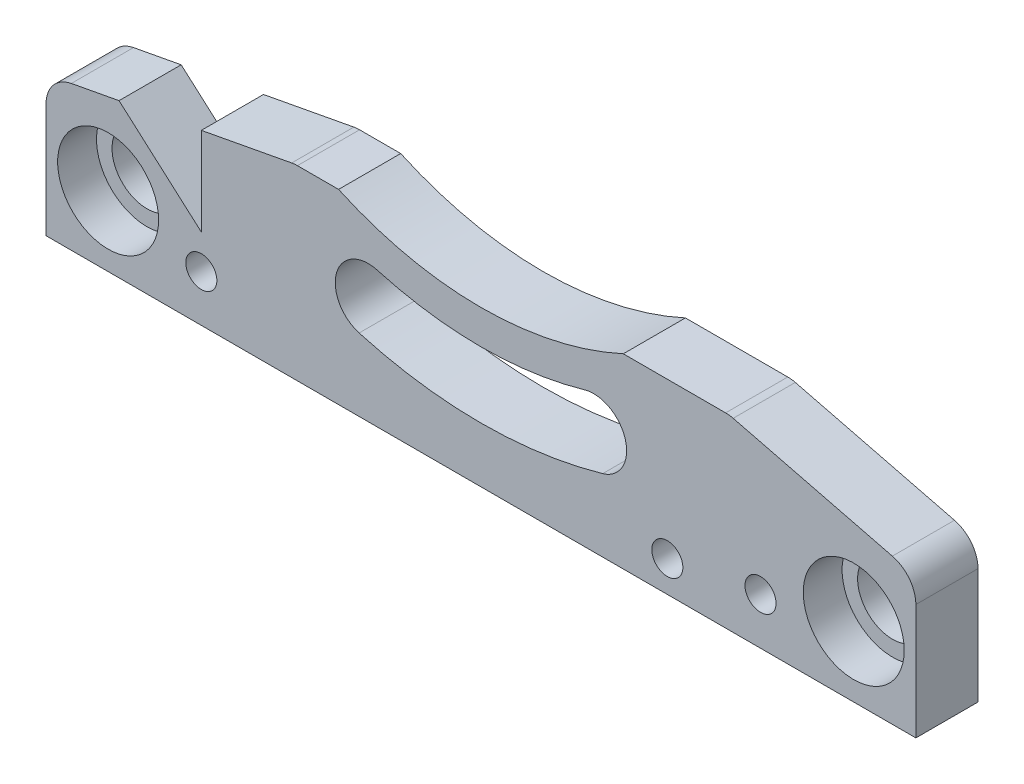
ISO-10303-21;
HEADER;
FILE_DESCRIPTION(('STEP AP214'),'2;1');
FILE_NAME('part.step','',(''),(''),'','','');
FILE_SCHEMA(('AUTOMOTIVE_DESIGN { 1 0 10303 214 1 1 1 1 }'));
ENDSEC;
DATA;
#1=APPLICATION_CONTEXT('core data for automotive mechanical design processes');
#2=APPLICATION_PROTOCOL_DEFINITION('international standard','automotive_design',2000,#1);
#3=PRODUCT_CONTEXT('',#1,'mechanical');
#4=PRODUCT('Part','Part','',(#3));
#5=PRODUCT_RELATED_PRODUCT_CATEGORY('part','',(#4));
#6=PRODUCT_DEFINITION_FORMATION('','',#4);
#7=PRODUCT_DEFINITION_CONTEXT('part definition',#1,'design');
#8=PRODUCT_DEFINITION('design','',#6,#7);
#9=PRODUCT_DEFINITION_SHAPE('','',#8);
#10=(LENGTH_UNIT() NAMED_UNIT(*) SI_UNIT(.MILLI.,.METRE.));
#11=(NAMED_UNIT(*) PLANE_ANGLE_UNIT() SI_UNIT($,.RADIAN.));
#12=(NAMED_UNIT(*) SI_UNIT($,.STERADIAN.) SOLID_ANGLE_UNIT());
#13=UNCERTAINTY_MEASURE_WITH_UNIT(LENGTH_MEASURE(1.E-05),#10,'distance_accuracy_value','');
#14=(GEOMETRIC_REPRESENTATION_CONTEXT(3) GLOBAL_UNCERTAINTY_ASSIGNED_CONTEXT((#13)) GLOBAL_UNIT_ASSIGNED_CONTEXT((#10,
#11,#12)) REPRESENTATION_CONTEXT('',''));
#15=CARTESIAN_POINT('',(0.,0.,0.));
#16=DIRECTION('',(0.,0.,1.));
#17=DIRECTION('',(1.,0.,0.));
#18=AXIS2_PLACEMENT_3D('',#15,#16,#17);
#19=CARTESIAN_POINT('',(-44.45,19.05,0.));
#20=DIRECTION('',(0.,0.,1.));
#21=DIRECTION('',(1.,0.,0.));
#22=AXIS2_PLACEMENT_3D('',#19,#20,#21);
#23=PLANE('',#22);
#24=CARTESIAN_POINT('',(-28.575,4.7625,0.));
#25=DIRECTION('',(0.,0.,1.));
#26=DIRECTION('',(1.,0.,0.));
#27=AXIS2_PLACEMENT_3D('',#24,#25,#26);
#28=CIRCLE('',#27,1.5875);
#29=CARTESIAN_POINT('',(-26.9875,4.7625,0.));
#30=VERTEX_POINT('',#29);
#31=EDGE_CURVE('E576',#30,#30,#28,.T.);
#32=ORIENTED_EDGE('',*,*,#31,.T.);
#33=EDGE_LOOP('',(#32));
#34=FACE_BOUND('',#33,.T.);
#35=CARTESIAN_POINT('',(19.05,3.17500000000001,0.));
#36=DIRECTION('',(0.,0.,1.));
#37=DIRECTION('',(1.,0.,0.));
#38=AXIS2_PLACEMENT_3D('',#35,#36,#37);
#39=CIRCLE('',#38,1.5875);
#40=CARTESIAN_POINT('',(20.6375,3.17500000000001,0.));
#41=VERTEX_POINT('',#40);
#42=EDGE_CURVE('E583',#41,#41,#39,.T.);
#43=ORIENTED_EDGE('',*,*,#42,.T.);
#44=EDGE_LOOP('',(#43));
#45=FACE_BOUND('',#44,.T.);
#46=CARTESIAN_POINT('',(28.575,4.7625,0.));
#47=DIRECTION('',(0.,0.,1.));
#48=DIRECTION('',(1.,0.,0.));
#49=AXIS2_PLACEMENT_3D('',#46,#47,#48);
#50=CIRCLE('',#49,1.5875);
#51=CARTESIAN_POINT('',(30.1625,4.7625,0.));
#52=VERTEX_POINT('',#51);
#53=EDGE_CURVE('E590',#52,#52,#50,.T.);
#54=ORIENTED_EDGE('',*,*,#53,.T.);
#55=EDGE_LOOP('',(#54));
#56=FACE_BOUND('',#55,.T.);
#57=CARTESIAN_POINT('',(-38.1,7.14375,0.));
#58=DIRECTION('',(0.,0.,1.));
#59=DIRECTION('',(1.,0.,0.));
#60=AXIS2_PLACEMENT_3D('',#57,#58,#59);
#61=CIRCLE('',#60,3.57187500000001);
#62=CARTESIAN_POINT('',(-34.528125,7.14375,0.));
#63=VERTEX_POINT('',#62);
#64=EDGE_CURVE('E593',#63,#63,#61,.T.);
#65=ORIENTED_EDGE('',*,*,#64,.T.);
#66=EDGE_LOOP('',(#65));
#67=FACE_BOUND('',#66,.T.);
#68=CARTESIAN_POINT('',(-11.5169556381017,10.6356025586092,0.));
#69=DIRECTION('',(0.,0.,-1.));
#70=DIRECTION('',(-1.,0.,0.));
#71=AXIS2_PLACEMENT_3D('',#68,#69,#70);
#72=CIRCLE('',#71,3.3734375);
#73=CARTESIAN_POINT('',(-12.4468010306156,7.39284630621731,0.));
#74=VERTEX_POINT('',#73);
#75=CARTESIAN_POINT('',(-10.5871102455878,13.8783588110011,0.));
#76=VERTEX_POINT('',#75);
#77=EDGE_CURVE('E166',#74,#76,#72,.T.);
#78=ORIENTED_EDGE('',*,*,#77,.F.);
#79=CARTESIAN_POINT('',(0.,50.8,0.));
#80=DIRECTION('',(0.,0.,-1.));
#81=DIRECTION('',(-1.,0.,0.));
#82=AXIS2_PLACEMENT_3D('',#79,#80,#81);
#83=CIRCLE('',#82,45.1564375);
#84=CARTESIAN_POINT('',(12.4468010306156,7.39284630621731,0.));
#85=VERTEX_POINT('',#84);
#86=EDGE_CURVE('E191',#85,#74,#83,.T.);
#87=ORIENTED_EDGE('',*,*,#86,.F.);
#88=CARTESIAN_POINT('',(11.5169556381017,10.6356025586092,0.));
#89=DIRECTION('',(0.,0.,-1.));
#90=DIRECTION('',(-1.,0.,0.));
#91=AXIS2_PLACEMENT_3D('',#88,#89,#90);
#92=CIRCLE('',#91,3.3734375);
#93=CARTESIAN_POINT('',(10.5871102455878,13.8783588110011,0.));
#94=VERTEX_POINT('',#93);
#95=EDGE_CURVE('E189',#94,#85,#92,.T.);
#96=ORIENTED_EDGE('',*,*,#95,.F.);
#97=CARTESIAN_POINT('',(0.,50.8,0.));
#98=DIRECTION('',(0.,0.,1.));
#99=DIRECTION('',(1.,0.,0.));
#100=AXIS2_PLACEMENT_3D('',#97,#98,#99);
#101=CIRCLE('',#100,38.4095625);
#102=EDGE_CURVE('E176',#76,#94,#101,.T.);
#103=ORIENTED_EDGE('',*,*,#102,.F.);
#104=EDGE_LOOP('',(#78,#87,#96,#103));
#105=FACE_BOUND('',#104,.T.);
#106=DIRECTION('',(-0.970142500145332,0.242535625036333,0.));
#107=VECTOR('',#106,1.);
#108=CARTESIAN_POINT('',(44.45,14.2875,0.));
#109=LINE('',#108,#107);
#110=CARTESIAN_POINT('',(42.0450506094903,14.8887373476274,0.));
#111=VERTEX_POINT('',#110);
#112=CARTESIAN_POINT('',(25.7791902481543,18.9552024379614,0.));
#113=VERTEX_POINT('',#112);
#114=EDGE_CURVE('E243',#111,#113,#109,.T.);
#115=ORIENTED_EDGE('',*,*,#114,.F.);
#116=CARTESIAN_POINT('',(41.275,11.808534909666,0.));
#117=DIRECTION('',(0.,0.,1.));
#118=DIRECTION('',(1.,0.,0.));
#119=AXIS2_PLACEMENT_3D('',#116,#117,#118);
#120=CIRCLE('',#119,3.175);
#121=CARTESIAN_POINT('',(44.45,11.808534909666,0.));
#122=VERTEX_POINT('',#121);
#123=EDGE_CURVE('E299',#111,#122,#120,.F.);
#124=ORIENTED_EDGE('',*,*,#123,.T.);
#125=DIRECTION('',(0.,1.,0.));
#126=VECTOR('',#125,1.);
#127=CARTESIAN_POINT('',(44.45,0.,0.));
#128=LINE('',#127,#126);
#129=CARTESIAN_POINT('',(44.45,0.,0.));
#130=VERTEX_POINT('',#129);
#131=EDGE_CURVE('E264',#130,#122,#128,.T.);
#132=ORIENTED_EDGE('',*,*,#131,.F.);
#133=DIRECTION('',(-1.,0.,0.));
#134=VECTOR('',#133,1.);
#135=CARTESIAN_POINT('',(44.45,0.,0.));
#136=LINE('',#135,#134);
#137=CARTESIAN_POINT('',(-44.45,0.,0.));
#138=VERTEX_POINT('',#137);
#139=EDGE_CURVE('E267',#130,#138,#136,.T.);
#140=ORIENTED_EDGE('',*,*,#139,.T.);
#141=DIRECTION('',(0.,1.,0.));
#142=VECTOR('',#141,1.);
#143=CARTESIAN_POINT('',(-44.45,0.,0.));
#144=LINE('',#143,#142);
#145=CARTESIAN_POINT('',(-44.45,11.6524840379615,0.));
#146=VERTEX_POINT('',#145);
#147=EDGE_CURVE('E270',#138,#146,#144,.T.);
#148=ORIENTED_EDGE('',*,*,#147,.T.);
#149=CARTESIAN_POINT('',(-41.275,11.6524840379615,0.));
#150=DIRECTION('',(0.,0.,1.));
#151=DIRECTION('',(1.,0.,0.));
#152=AXIS2_PLACEMENT_3D('',#149,#150,#151);
#153=CIRCLE('',#152,3.175);
#154=CARTESIAN_POINT('',(-41.8601160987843,14.7731032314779,0.));
#155=VERTEX_POINT('',#154);
#156=EDGE_CURVE('E49',#146,#155,#153,.F.);
#157=ORIENTED_EDGE('',*,*,#156,.T.);
#158=DIRECTION('',(-0.982872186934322,-0.184288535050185,0.));
#159=VECTOR('',#158,1.);
#160=CARTESIAN_POINT('',(-43.587358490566,14.4492452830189,0.));
#161=LINE('',#160,#159);
#162=CARTESIAN_POINT('',(-36.9843867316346,15.6873024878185,0.));
#163=VERTEX_POINT('',#162);
#164=EDGE_CURVE('E230',#163,#155,#161,.T.);
#165=ORIENTED_EDGE('',*,*,#164,.F.);
#166=DIRECTION('',(0.749616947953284,-0.661871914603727,0.));
#167=VECTOR('',#166,1.);
#168=CARTESIAN_POINT('',(-36.9843867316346,15.6873024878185,0.));
#169=LINE('',#168,#167);
#170=CARTESIAN_POINT('',(-28.575,8.26226105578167,0.));
#171=VERTEX_POINT('',#170);
#172=EDGE_CURVE('E212',#163,#171,#169,.T.);
#173=ORIENTED_EDGE('',*,*,#172,.T.);
#174=DIRECTION('',(0.,1.,0.));
#175=VECTOR('',#174,1.);
#176=CARTESIAN_POINT('',(-28.575,8.26226105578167,0.));
#177=LINE('',#176,#175);
#178=CARTESIAN_POINT('',(-28.575,17.2640625,0.));
#179=VERTEX_POINT('',#178);
#180=EDGE_CURVE('E209',#171,#179,#177,.T.);
#181=ORIENTED_EDGE('',*,*,#180,.T.);
#182=CARTESIAN_POINT('',(-19.3400309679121,18.9956191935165,0.));
#183=VERTEX_POINT('',#182);
#184=EDGE_CURVE('E231',#183,#179,#161,.T.);
#185=ORIENTED_EDGE('',*,*,#184,.F.);
#186=CARTESIAN_POINT('',(-18.7549148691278,15.875,0.));
#187=DIRECTION('',(0.,0.,1.));
#188=DIRECTION('',(1.,0.,0.));
#189=AXIS2_PLACEMENT_3D('',#186,#187,#188);
#190=CIRCLE('',#189,3.175);
#191=CARTESIAN_POINT('',(-18.7549148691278,19.05,0.));
#192=VERTEX_POINT('',#191);
#193=EDGE_CURVE('E296',#183,#192,#190,.F.);
#194=ORIENTED_EDGE('',*,*,#193,.T.);
#195=DIRECTION('',(1.,0.,0.));
#196=VECTOR('',#195,1.);
#197=CARTESIAN_POINT('',(-44.45,19.05,0.));
#198=LINE('',#197,#196);
#199=CARTESIAN_POINT('',(-14.5496778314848,19.05,0.));
#200=VERTEX_POINT('',#199);
#201=EDGE_CURVE('E262',#192,#200,#198,.T.);
#202=ORIENTED_EDGE('',*,*,#201,.T.);
#203=CARTESIAN_POINT('',(0.,50.8,0.));
#204=DIRECTION('',(0.,0.,1.));
#205=DIRECTION('',(1.,0.,0.));
#206=AXIS2_PLACEMENT_3D('',#203,#204,#205);
#207=CIRCLE('',#206,34.925);
#208=CARTESIAN_POINT('',(14.5496778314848,19.05,0.));
#209=VERTEX_POINT('',#208);
#210=EDGE_CURVE('E274',#209,#200,#207,.F.);
#211=ORIENTED_EDGE('',*,*,#210,.F.);
#212=CARTESIAN_POINT('',(25.0091396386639,19.05,0.));
#213=VERTEX_POINT('',#212);
#214=EDGE_CURVE('E246',#209,#213,#198,.T.);
#215=ORIENTED_EDGE('',*,*,#214,.T.);
#216=CARTESIAN_POINT('',(25.0091396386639,15.875,0.));
#217=DIRECTION('',(0.,0.,1.));
#218=DIRECTION('',(1.,0.,0.));
#219=AXIS2_PLACEMENT_3D('',#216,#217,#218);
#220=CIRCLE('',#219,3.175);
#221=EDGE_CURVE('E294',#213,#113,#220,.F.);
#222=ORIENTED_EDGE('',*,*,#221,.T.);
#223=EDGE_LOOP('',(#115,#124,#132,#140,#148,#157,#165,#173,#181,#185,#194,#202,#211,#215,#222));
#224=FACE_BOUND('',#223,.T.);
#225=CARTESIAN_POINT('',(38.1,7.14375,0.));
#226=DIRECTION('',(0.,0.,1.));
#227=DIRECTION('',(1.,0.,0.));
#228=AXIS2_PLACEMENT_3D('',#225,#226,#227);
#229=CIRCLE('',#228,3.57187500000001);
#230=CARTESIAN_POINT('',(41.671875,7.14375,0.));
#231=VERTEX_POINT('',#230);
#232=EDGE_CURVE('E607',#231,#231,#229,.T.);
#233=ORIENTED_EDGE('',*,*,#232,.T.);
#234=EDGE_LOOP('',(#233));
#235=FACE_BOUND('',#234,.T.);
#236=ADVANCED_FACE('F34',(#34,#45,#56,#67,#105,#224,#235),#23,.F.);
#237=CARTESIAN_POINT('',(-44.45,19.05,6.35));
#238=DIRECTION('',(0.,0.,1.));
#239=DIRECTION('',(1.,0.,0.));
#240=AXIS2_PLACEMENT_3D('',#237,#238,#239);
#241=PLANE('',#240);
#242=CARTESIAN_POINT('',(-28.575,4.7625,6.35));
#243=DIRECTION('',(0.,0.,1.));
#244=DIRECTION('',(1.,0.,0.));
#245=AXIS2_PLACEMENT_3D('',#242,#243,#244);
#246=CIRCLE('',#245,1.5875);
#247=CARTESIAN_POINT('',(-26.9875,4.7625,6.35));
#248=VERTEX_POINT('',#247);
#249=EDGE_CURVE('E579',#248,#248,#246,.T.);
#250=ORIENTED_EDGE('',*,*,#249,.F.);
#251=EDGE_LOOP('',(#250));
#252=FACE_BOUND('',#251,.T.);
#253=CARTESIAN_POINT('',(19.05,3.17500000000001,6.34999999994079));
#254=DIRECTION('',(0.,0.,1.));
#255=DIRECTION('',(1.,0.,0.));
#256=AXIS2_PLACEMENT_3D('',#253,#254,#255);
#257=CIRCLE('',#256,1.5875);
#258=CARTESIAN_POINT('',(20.6375,3.17500000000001,6.34999999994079));
#259=VERTEX_POINT('',#258);
#260=EDGE_CURVE('E580',#259,#259,#257,.T.);
#261=ORIENTED_EDGE('',*,*,#260,.F.);
#262=EDGE_LOOP('',(#261));
#263=FACE_BOUND('',#262,.T.);
#264=CARTESIAN_POINT('',(28.575,4.7625,6.35));
#265=DIRECTION('',(0.,0.,1.));
#266=DIRECTION('',(1.,0.,0.));
#267=AXIS2_PLACEMENT_3D('',#264,#265,#266);
#268=CIRCLE('',#267,1.5875);
#269=CARTESIAN_POINT('',(30.1625,4.7625,6.35));
#270=VERTEX_POINT('',#269);
#271=EDGE_CURVE('E588',#270,#270,#268,.T.);
#272=ORIENTED_EDGE('',*,*,#271,.F.);
#273=EDGE_LOOP('',(#272));
#274=FACE_BOUND('',#273,.T.);
#275=CARTESIAN_POINT('',(-38.1,7.14375,6.35));
#276=DIRECTION('',(0.,0.,1.));
#277=DIRECTION('',(1.,0.,0.));
#278=AXIS2_PLACEMENT_3D('',#275,#276,#277);
#279=CIRCLE('',#278,5.15937499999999);
#280=CARTESIAN_POINT('',(-32.940625,7.14375,6.35));
#281=VERTEX_POINT('',#280);
#282=EDGE_CURVE('E604',#281,#281,#279,.T.);
#283=ORIENTED_EDGE('',*,*,#282,.F.);
#284=EDGE_LOOP('',(#283));
#285=FACE_BOUND('',#284,.T.);
#286=CARTESIAN_POINT('',(0.,50.8,6.35));
#287=DIRECTION('',(0.,0.,-1.));
#288=DIRECTION('',(-1.,0.,0.));
#289=AXIS2_PLACEMENT_3D('',#286,#287,#288);
#290=CIRCLE('',#289,45.1564375);
#291=CARTESIAN_POINT('',(12.4468010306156,7.39284630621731,6.35));
#292=VERTEX_POINT('',#291);
#293=CARTESIAN_POINT('',(-12.4468010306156,7.39284630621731,6.35));
#294=VERTEX_POINT('',#293);
#295=EDGE_CURVE('E177',#292,#294,#290,.T.);
#296=ORIENTED_EDGE('',*,*,#295,.T.);
#297=CARTESIAN_POINT('',(-11.5169556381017,10.6356025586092,6.35));
#298=DIRECTION('',(0.,0.,-1.));
#299=DIRECTION('',(-1.,0.,0.));
#300=AXIS2_PLACEMENT_3D('',#297,#298,#299);
#301=CIRCLE('',#300,3.3734375);
#302=CARTESIAN_POINT('',(-10.5871102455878,13.8783588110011,6.35));
#303=VERTEX_POINT('',#302);
#304=EDGE_CURVE('E196',#294,#303,#301,.T.);
#305=ORIENTED_EDGE('',*,*,#304,.T.);
#306=CARTESIAN_POINT('',(0.,50.8,6.35));
#307=DIRECTION('',(0.,0.,1.));
#308=DIRECTION('',(1.,0.,0.));
#309=AXIS2_PLACEMENT_3D('',#306,#307,#308);
#310=CIRCLE('',#309,38.4095625);
#311=CARTESIAN_POINT('',(10.5871102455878,13.8783588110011,6.35));
#312=VERTEX_POINT('',#311);
#313=EDGE_CURVE('E183',#303,#312,#310,.T.);
#314=ORIENTED_EDGE('',*,*,#313,.T.);
#315=CARTESIAN_POINT('',(11.5169556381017,10.6356025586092,6.35));
#316=DIRECTION('',(0.,0.,-1.));
#317=DIRECTION('',(-1.,0.,0.));
#318=AXIS2_PLACEMENT_3D('',#315,#316,#317);
#319=CIRCLE('',#318,3.3734375);
#320=EDGE_CURVE('E200',#312,#292,#319,.T.);
#321=ORIENTED_EDGE('',*,*,#320,.T.);
#322=EDGE_LOOP('',(#296,#305,#314,#321));
#323=FACE_BOUND('',#322,.T.);
#324=DIRECTION('',(0.,1.,0.));
#325=VECTOR('',#324,1.);
#326=CARTESIAN_POINT('',(44.45,0.,6.35));
#327=LINE('',#326,#325);
#328=CARTESIAN_POINT('',(44.45,0.,6.35));
#329=VERTEX_POINT('',#328);
#330=CARTESIAN_POINT('',(44.45,11.808534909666,6.35));
#331=VERTEX_POINT('',#330);
#332=EDGE_CURVE('E251',#329,#331,#327,.T.);
#333=ORIENTED_EDGE('',*,*,#332,.T.);
#334=CARTESIAN_POINT('',(41.275,11.808534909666,6.35));
#335=DIRECTION('',(0.,0.,1.));
#336=DIRECTION('',(1.,0.,0.));
#337=AXIS2_PLACEMENT_3D('',#334,#335,#336);
#338=CIRCLE('',#337,3.175);
#339=CARTESIAN_POINT('',(42.0450506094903,14.8887373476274,6.35));
#340=VERTEX_POINT('',#339);
#341=EDGE_CURVE('E287',#331,#340,#338,.T.);
#342=ORIENTED_EDGE('',*,*,#341,.T.);
#343=DIRECTION('',(-0.970142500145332,0.242535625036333,0.));
#344=VECTOR('',#343,1.);
#345=CARTESIAN_POINT('',(44.45,14.2875,6.35));
#346=LINE('',#345,#344);
#347=CARTESIAN_POINT('',(25.7791902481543,18.9552024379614,6.35));
#348=VERTEX_POINT('',#347);
#349=EDGE_CURVE('E240',#340,#348,#346,.T.);
#350=ORIENTED_EDGE('',*,*,#349,.T.);
#351=CARTESIAN_POINT('',(25.0091396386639,15.875,6.35));
#352=DIRECTION('',(0.,0.,1.));
#353=DIRECTION('',(1.,0.,0.));
#354=AXIS2_PLACEMENT_3D('',#351,#352,#353);
#355=CIRCLE('',#354,3.175);
#356=CARTESIAN_POINT('',(25.0091396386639,19.05,6.35));
#357=VERTEX_POINT('',#356);
#358=EDGE_CURVE('E281',#348,#357,#355,.T.);
#359=ORIENTED_EDGE('',*,*,#358,.T.);
#360=DIRECTION('',(1.,0.,0.));
#361=VECTOR('',#360,1.);
#362=CARTESIAN_POINT('',(-44.45,19.05,6.35));
#363=LINE('',#362,#361);
#364=CARTESIAN_POINT('',(14.5496778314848,19.05,6.35));
#365=VERTEX_POINT('',#364);
#366=EDGE_CURVE('E252',#365,#357,#363,.T.);
#367=ORIENTED_EDGE('',*,*,#366,.F.);
#368=CARTESIAN_POINT('',(0.,50.8,6.35));
#369=DIRECTION('',(0.,0.,1.));
#370=DIRECTION('',(1.,0.,0.));
#371=AXIS2_PLACEMENT_3D('',#368,#369,#370);
#372=CIRCLE('',#371,34.925);
#373=CARTESIAN_POINT('',(-14.5496778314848,19.05,6.35));
#374=VERTEX_POINT('',#373);
#375=EDGE_CURVE('E234',#374,#365,#372,.T.);
#376=ORIENTED_EDGE('',*,*,#375,.F.);
#377=CARTESIAN_POINT('',(-18.7549148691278,19.05,6.35));
#378=VERTEX_POINT('',#377);
#379=EDGE_CURVE('E249',#378,#374,#363,.T.);
#380=ORIENTED_EDGE('',*,*,#379,.F.);
#381=CARTESIAN_POINT('',(-18.7549148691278,15.875,6.35));
#382=DIRECTION('',(0.,0.,1.));
#383=DIRECTION('',(1.,0.,0.));
#384=AXIS2_PLACEMENT_3D('',#381,#382,#383);
#385=CIRCLE('',#384,3.175);
#386=CARTESIAN_POINT('',(-19.3400309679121,18.9956191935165,6.35));
#387=VERTEX_POINT('',#386);
#388=EDGE_CURVE('E283',#378,#387,#385,.T.);
#389=ORIENTED_EDGE('',*,*,#388,.T.);
#390=DIRECTION('',(0.982872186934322,0.184288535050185,0.));
#391=VECTOR('',#390,1.);
#392=CARTESIAN_POINT('',(-44.45,14.2875,6.35));
#393=LINE('',#392,#391);
#394=CARTESIAN_POINT('',(-28.575,17.2640625,6.35));
#395=VERTEX_POINT('',#394);
#396=EDGE_CURVE('E227',#395,#387,#393,.T.);
#397=ORIENTED_EDGE('',*,*,#396,.F.);
#398=DIRECTION('',(0.,1.,0.));
#399=VECTOR('',#398,1.);
#400=CARTESIAN_POINT('',(-28.575,8.26226105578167,6.35));
#401=LINE('',#400,#399);
#402=CARTESIAN_POINT('',(-28.575,8.26226105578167,6.35));
#403=VERTEX_POINT('',#402);
#404=EDGE_CURVE('E184',#403,#395,#401,.T.);
#405=ORIENTED_EDGE('',*,*,#404,.F.);
#406=DIRECTION('',(0.749616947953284,-0.661871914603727,0.));
#407=VECTOR('',#406,1.);
#408=CARTESIAN_POINT('',(-36.9843867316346,15.6873024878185,6.35));
#409=LINE('',#408,#407);
#410=CARTESIAN_POINT('',(-36.9843867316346,15.6873024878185,6.35));
#411=VERTEX_POINT('',#410);
#412=EDGE_CURVE('E213',#411,#403,#409,.T.);
#413=ORIENTED_EDGE('',*,*,#412,.F.);
#414=CARTESIAN_POINT('',(-41.8601160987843,14.7731032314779,6.35));
#415=VERTEX_POINT('',#414);
#416=EDGE_CURVE('E228',#415,#411,#393,.T.);
#417=ORIENTED_EDGE('',*,*,#416,.F.);
#418=CARTESIAN_POINT('',(-41.275,11.6524840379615,6.35));
#419=DIRECTION('',(0.,0.,1.));
#420=DIRECTION('',(1.,0.,0.));
#421=AXIS2_PLACEMENT_3D('',#418,#419,#420);
#422=CIRCLE('',#421,3.175);
#423=CARTESIAN_POINT('',(-44.45,11.6524840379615,6.35));
#424=VERTEX_POINT('',#423);
#425=EDGE_CURVE('E285',#415,#424,#422,.T.);
#426=ORIENTED_EDGE('',*,*,#425,.T.);
#427=DIRECTION('',(0.,1.,0.));
#428=VECTOR('',#427,1.);
#429=CARTESIAN_POINT('',(-44.45,0.,6.35));
#430=LINE('',#429,#428);
#431=CARTESIAN_POINT('',(-44.45,0.,6.35));
#432=VERTEX_POINT('',#431);
#433=EDGE_CURVE('E258',#432,#424,#430,.T.);
#434=ORIENTED_EDGE('',*,*,#433,.F.);
#435=DIRECTION('',(-1.,0.,0.));
#436=VECTOR('',#435,1.);
#437=CARTESIAN_POINT('',(44.45,0.,6.35));
#438=LINE('',#437,#436);
#439=EDGE_CURVE('E255',#329,#432,#438,.T.);
#440=ORIENTED_EDGE('',*,*,#439,.F.);
#441=EDGE_LOOP('',(#333,#342,#350,#359,#367,#376,#380,#389,#397,#405,#413,#417,#426,#434,#440));
#442=FACE_BOUND('',#441,.T.);
#443=CARTESIAN_POINT('',(38.1,7.14375,6.35));
#444=DIRECTION('',(0.,0.,1.));
#445=DIRECTION('',(1.,0.,0.));
#446=AXIS2_PLACEMENT_3D('',#443,#444,#445);
#447=CIRCLE('',#446,5.15937499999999);
#448=CARTESIAN_POINT('',(43.259375,7.14375,6.35));
#449=VERTEX_POINT('',#448);
#450=EDGE_CURVE('E198',#449,#449,#447,.T.);
#451=ORIENTED_EDGE('',*,*,#450,.F.);
#452=EDGE_LOOP('',(#451));
#453=FACE_BOUND('',#452,.T.);
#454=ADVANCED_FACE('F316',(#252,#263,#274,#285,#323,#442,#453),#241,.T.);
#455=CARTESIAN_POINT('',(-44.45,14.2875,6.35));
#456=DIRECTION('',(-0.184288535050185,0.982872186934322,0.));
#457=DIRECTION('',(-0.982872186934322,-0.184288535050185,0.));
#458=AXIS2_PLACEMENT_3D('',#455,#456,#457);
#459=PLANE('',#458);
#460=ORIENTED_EDGE('',*,*,#396,.T.);
#461=DIRECTION('',(0.,0.,-1.));
#462=VECTOR('',#461,1.);
#463=CARTESIAN_POINT('',(-19.3400309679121,18.9956191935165,6.35));
#464=LINE('',#463,#462);
#465=EDGE_CURVE('E305',#387,#183,#464,.T.);
#466=ORIENTED_EDGE('',*,*,#465,.T.);
#467=ORIENTED_EDGE('',*,*,#184,.T.);
#468=DIRECTION('',(0.,0.,1.));
#469=VECTOR('',#468,1.);
#470=CARTESIAN_POINT('',(-28.575,17.2640625,0.));
#471=LINE('',#470,#469);
#472=EDGE_CURVE('E224',#179,#395,#471,.T.);
#473=ORIENTED_EDGE('',*,*,#472,.T.);
#474=EDGE_LOOP('',(#460,#466,#467,#473));
#475=FACE_BOUND('',#474,.T.);
#476=ADVANCED_FACE('F326',(#475),#459,.T.);
#477=CARTESIAN_POINT('',(-44.45,19.05,6.35));
#478=DIRECTION('',(0.,1.,0.));
#479=DIRECTION('',(-1.,0.,0.));
#480=AXIS2_PLACEMENT_3D('',#477,#478,#479);
#481=PLANE('',#480);
#482=ORIENTED_EDGE('',*,*,#201,.F.);
#483=DIRECTION('',(0.,0.,-1.));
#484=VECTOR('',#483,1.);
#485=CARTESIAN_POINT('',(-18.7549148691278,19.05,6.35));
#486=LINE('',#485,#484);
#487=EDGE_CURVE('E42',#192,#378,#486,.F.);
#488=ORIENTED_EDGE('',*,*,#487,.T.);
#489=ORIENTED_EDGE('',*,*,#379,.T.);
#490=DIRECTION('',(0.,0.,-1.));
#491=VECTOR('',#490,1.);
#492=CARTESIAN_POINT('',(-14.5496778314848,19.05,6.35));
#493=LINE('',#492,#491);
#494=EDGE_CURVE('E233',#374,#200,#493,.T.);
#495=ORIENTED_EDGE('',*,*,#494,.T.);
#496=EDGE_LOOP('',(#482,#488,#489,#495));
#497=FACE_BOUND('',#496,.T.);
#498=ADVANCED_FACE('F311',(#497),#481,.T.);
#499=CARTESIAN_POINT('',(-44.45,0.,6.35));
#500=DIRECTION('',(-1.,0.,0.));
#501=DIRECTION('',(0.,-1.,0.));
#502=AXIS2_PLACEMENT_3D('',#499,#500,#501);
#503=PLANE('',#502);
#504=ORIENTED_EDGE('',*,*,#433,.T.);
#505=DIRECTION('',(0.,0.,-1.));
#506=VECTOR('',#505,1.);
#507=CARTESIAN_POINT('',(-44.45,11.6524840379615,6.35));
#508=LINE('',#507,#506);
#509=EDGE_CURVE('E301',#424,#146,#508,.T.);
#510=ORIENTED_EDGE('',*,*,#509,.T.);
#511=ORIENTED_EDGE('',*,*,#147,.F.);
#512=DIRECTION('',(0.,0.,-1.));
#513=VECTOR('',#512,1.);
#514=CARTESIAN_POINT('',(-44.45,0.,6.35));
#515=LINE('',#514,#513);
#516=EDGE_CURVE('E272',#432,#138,#515,.T.);
#517=ORIENTED_EDGE('',*,*,#516,.F.);
#518=EDGE_LOOP('',(#504,#510,#511,#517));
#519=FACE_BOUND('',#518,.T.);
#520=ADVANCED_FACE('F346',(#519),#503,.T.);
#521=ORIENTED_EDGE('',*,*,#366,.T.);
#522=DIRECTION('',(0.,0.,1.));
#523=VECTOR('',#522,1.);
#524=CARTESIAN_POINT('',(25.0091396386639,19.05,6.35));
#525=LINE('',#524,#523);
#526=EDGE_CURVE('E11',#357,#213,#525,.F.);
#527=ORIENTED_EDGE('',*,*,#526,.T.);
#528=ORIENTED_EDGE('',*,*,#214,.F.);
#529=DIRECTION('',(0.,0.,-1.));
#530=VECTOR('',#529,1.);
#531=CARTESIAN_POINT('',(14.5496778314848,19.05,6.35));
#532=LINE('',#531,#530);
#533=EDGE_CURVE('E237',#365,#209,#532,.T.);
#534=ORIENTED_EDGE('',*,*,#533,.F.);
#535=EDGE_LOOP('',(#521,#527,#528,#534));
#536=FACE_BOUND('',#535,.T.);
#537=ADVANCED_FACE('F371',(#536),#481,.T.);
#538=CARTESIAN_POINT('',(44.45,0.,6.35));
#539=DIRECTION('',(-1.,0.,0.));
#540=DIRECTION('',(0.,-1.,0.));
#541=AXIS2_PLACEMENT_3D('',#538,#539,#540);
#542=PLANE('',#541);
#543=ORIENTED_EDGE('',*,*,#131,.T.);
#544=DIRECTION('',(0.,0.,1.));
#545=VECTOR('',#544,1.);
#546=CARTESIAN_POINT('',(44.45,11.808534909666,6.35));
#547=LINE('',#546,#545);
#548=EDGE_CURVE('E278',#122,#331,#547,.T.);
#549=ORIENTED_EDGE('',*,*,#548,.T.);
#550=ORIENTED_EDGE('',*,*,#332,.F.);
#551=DIRECTION('',(0.,0.,-1.));
#552=VECTOR('',#551,1.);
#553=CARTESIAN_POINT('',(44.45,0.,6.35));
#554=LINE('',#553,#552);
#555=EDGE_CURVE('E261',#329,#130,#554,.T.);
#556=ORIENTED_EDGE('',*,*,#555,.T.);
#557=EDGE_LOOP('',(#543,#549,#550,#556));
#558=FACE_BOUND('',#557,.T.);
#559=ADVANCED_FACE('F354',(#558),#542,.F.);
#560=CARTESIAN_POINT('',(44.45,0.,6.35));
#561=DIRECTION('',(0.,-1.,0.));
#562=DIRECTION('',(1.,0.,0.));
#563=AXIS2_PLACEMENT_3D('',#560,#561,#562);
#564=PLANE('',#563);
#565=ORIENTED_EDGE('',*,*,#139,.F.);
#566=ORIENTED_EDGE('',*,*,#555,.F.);
#567=ORIENTED_EDGE('',*,*,#439,.T.);
#568=ORIENTED_EDGE('',*,*,#516,.T.);
#569=EDGE_LOOP('',(#565,#566,#567,#568));
#570=FACE_BOUND('',#569,.T.);
#571=ADVANCED_FACE('F350',(#570),#564,.T.);
#572=CARTESIAN_POINT('',(44.45,14.2875,0.));
#573=DIRECTION('',(0.242535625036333,0.970142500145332,0.));
#574=DIRECTION('',(-0.970142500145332,0.242535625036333,0.));
#575=AXIS2_PLACEMENT_3D('',#572,#573,#574);
#576=PLANE('',#575);
#577=ORIENTED_EDGE('',*,*,#349,.F.);
#578=DIRECTION('',(0.,0.,1.));
#579=VECTOR('',#578,1.);
#580=CARTESIAN_POINT('',(42.0450506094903,14.8887373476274,0.));
#581=LINE('',#580,#579);
#582=EDGE_CURVE('E292',#340,#111,#581,.F.);
#583=ORIENTED_EDGE('',*,*,#582,.T.);
#584=ORIENTED_EDGE('',*,*,#114,.T.);
#585=DIRECTION('',(0.,0.,1.));
#586=VECTOR('',#585,1.);
#587=CARTESIAN_POINT('',(25.7791902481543,18.9552024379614,0.));
#588=LINE('',#587,#586);
#589=EDGE_CURVE('E289',#113,#348,#588,.T.);
#590=ORIENTED_EDGE('',*,*,#589,.T.);
#591=EDGE_LOOP('',(#577,#583,#584,#590));
#592=FACE_BOUND('',#591,.T.);
#593=ADVANCED_FACE('F362',(#592),#576,.T.);
#594=CARTESIAN_POINT('',(0.,50.8,6.35));
#595=DIRECTION('',(0.,0.,-1.));
#596=DIRECTION('',(-1.,0.,0.));
#597=AXIS2_PLACEMENT_3D('',#594,#595,#596);
#598=CYLINDRICAL_SURFACE('',#597,34.925);
#599=ORIENTED_EDGE('',*,*,#533,.T.);
#600=ORIENTED_EDGE('',*,*,#210,.T.);
#601=ORIENTED_EDGE('',*,*,#494,.F.);
#602=ORIENTED_EDGE('',*,*,#375,.T.);
#603=EDGE_LOOP('',(#599,#600,#601,#602));
#604=FACE_BOUND('',#603,.T.);
#605=ADVANCED_FACE('F373',(#604),#598,.F.);
#606=ORIENTED_EDGE('',*,*,#164,.T.);
#607=DIRECTION('',(0.,0.,-1.));
#608=VECTOR('',#607,1.);
#609=CARTESIAN_POINT('',(-41.8601160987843,14.7731032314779,6.35));
#610=LINE('',#609,#608);
#611=EDGE_CURVE('E303',#155,#415,#610,.F.);
#612=ORIENTED_EDGE('',*,*,#611,.T.);
#613=ORIENTED_EDGE('',*,*,#416,.T.);
#614=DIRECTION('',(0.,0.,1.));
#615=VECTOR('',#614,1.);
#616=CARTESIAN_POINT('',(-36.9843867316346,15.6873024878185,0.));
#617=LINE('',#616,#615);
#618=EDGE_CURVE('E216',#163,#411,#617,.T.);
#619=ORIENTED_EDGE('',*,*,#618,.F.);
#620=EDGE_LOOP('',(#606,#612,#613,#619));
#621=FACE_BOUND('',#620,.T.);
#622=ADVANCED_FACE('F341',(#621),#459,.T.);
#623=CARTESIAN_POINT('',(-28.575,8.26226105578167,0.));
#624=DIRECTION('',(1.,0.,0.));
#625=DIRECTION('',(0.,0.,-1.));
#626=AXIS2_PLACEMENT_3D('',#623,#624,#625);
#627=PLANE('',#626);
#628=ORIENTED_EDGE('',*,*,#404,.T.);
#629=ORIENTED_EDGE('',*,*,#472,.F.);
#630=ORIENTED_EDGE('',*,*,#180,.F.);
#631=DIRECTION('',(0.,0.,1.));
#632=VECTOR('',#631,1.);
#633=CARTESIAN_POINT('',(-28.575,8.26226105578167,0.));
#634=LINE('',#633,#632);
#635=EDGE_CURVE('E222',#171,#403,#634,.T.);
#636=ORIENTED_EDGE('',*,*,#635,.T.);
#637=EDGE_LOOP('',(#628,#629,#630,#636));
#638=FACE_BOUND('',#637,.T.);
#639=ADVANCED_FACE('F332',(#638),#627,.F.);
#640=CARTESIAN_POINT('',(-36.9843867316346,15.6873024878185,0.));
#641=DIRECTION('',(-0.661871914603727,-0.749616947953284,0.));
#642=DIRECTION('',(0.749616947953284,-0.661871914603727,0.));
#643=AXIS2_PLACEMENT_3D('',#640,#641,#642);
#644=PLANE('',#643);
#645=ORIENTED_EDGE('',*,*,#412,.T.);
#646=ORIENTED_EDGE('',*,*,#635,.F.);
#647=ORIENTED_EDGE('',*,*,#172,.F.);
#648=ORIENTED_EDGE('',*,*,#618,.T.);
#649=EDGE_LOOP('',(#645,#646,#647,#648));
#650=FACE_BOUND('',#649,.T.);
#651=ADVANCED_FACE('F338',(#650),#644,.F.);
#652=CARTESIAN_POINT('',(-11.5169556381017,10.6356025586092,0.));
#653=DIRECTION('',(0.,0.,1.));
#654=DIRECTION('',(1.,0.,0.));
#655=AXIS2_PLACEMENT_3D('',#652,#653,#654);
#656=CYLINDRICAL_SURFACE('',#655,3.3734375);
#657=ORIENTED_EDGE('',*,*,#304,.F.);
#658=DIRECTION('',(0.,0.,1.));
#659=VECTOR('',#658,1.);
#660=CARTESIAN_POINT('',(-12.4468010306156,7.39284630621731,0.));
#661=LINE('',#660,#659);
#662=EDGE_CURVE('E172',#74,#294,#661,.T.);
#663=ORIENTED_EDGE('',*,*,#662,.F.);
#664=ORIENTED_EDGE('',*,*,#77,.T.);
#665=DIRECTION('',(0.,0.,1.));
#666=VECTOR('',#665,1.);
#667=CARTESIAN_POINT('',(-10.5871102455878,13.8783588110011,0.));
#668=LINE('',#667,#666);
#669=EDGE_CURVE('E169',#76,#303,#668,.T.);
#670=ORIENTED_EDGE('',*,*,#669,.T.);
#671=EDGE_LOOP('',(#657,#663,#664,#670));
#672=FACE_BOUND('',#671,.T.);
#673=ADVANCED_FACE('F168',(#672),#656,.F.);
#674=CARTESIAN_POINT('',(0.,50.8,0.));
#675=DIRECTION('',(0.,0.,1.));
#676=DIRECTION('',(1.,0.,0.));
#677=AXIS2_PLACEMENT_3D('',#674,#675,#676);
#678=CYLINDRICAL_SURFACE('',#677,38.4095625);
#679=ORIENTED_EDGE('',*,*,#313,.F.);
#680=ORIENTED_EDGE('',*,*,#669,.F.);
#681=ORIENTED_EDGE('',*,*,#102,.T.);
#682=DIRECTION('',(0.,0.,1.));
#683=VECTOR('',#682,1.);
#684=CARTESIAN_POINT('',(10.5871102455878,13.8783588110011,0.));
#685=LINE('',#684,#683);
#686=EDGE_CURVE('E185',#94,#312,#685,.T.);
#687=ORIENTED_EDGE('',*,*,#686,.T.);
#688=EDGE_LOOP('',(#679,#680,#681,#687));
#689=FACE_BOUND('',#688,.T.);
#690=ADVANCED_FACE('F180',(#689),#678,.T.);
#691=CARTESIAN_POINT('',(11.5169556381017,10.6356025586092,0.));
#692=DIRECTION('',(0.,0.,1.));
#693=DIRECTION('',(1.,0.,0.));
#694=AXIS2_PLACEMENT_3D('',#691,#692,#693);
#695=CYLINDRICAL_SURFACE('',#694,3.3734375);
#696=ORIENTED_EDGE('',*,*,#320,.F.);
#697=ORIENTED_EDGE('',*,*,#686,.F.);
#698=ORIENTED_EDGE('',*,*,#95,.T.);
#699=DIRECTION('',(0.,0.,1.));
#700=VECTOR('',#699,1.);
#701=CARTESIAN_POINT('',(12.4468010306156,7.39284630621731,0.));
#702=LINE('',#701,#700);
#703=EDGE_CURVE('E206',#85,#292,#702,.T.);
#704=ORIENTED_EDGE('',*,*,#703,.T.);
#705=EDGE_LOOP('',(#696,#697,#698,#704));
#706=FACE_BOUND('',#705,.T.);
#707=ADVANCED_FACE('F428',(#706),#695,.F.);
#708=CARTESIAN_POINT('',(0.,50.8,0.));
#709=DIRECTION('',(0.,0.,1.));
#710=DIRECTION('',(1.,0.,0.));
#711=AXIS2_PLACEMENT_3D('',#708,#709,#710);
#712=CYLINDRICAL_SURFACE('',#711,45.1564375);
#713=ORIENTED_EDGE('',*,*,#295,.F.);
#714=ORIENTED_EDGE('',*,*,#703,.F.);
#715=ORIENTED_EDGE('',*,*,#86,.T.);
#716=ORIENTED_EDGE('',*,*,#662,.T.);
#717=EDGE_LOOP('',(#713,#714,#715,#716));
#718=FACE_BOUND('',#717,.T.);
#719=ADVANCED_FACE('F403',(#718),#712,.F.);
#720=CARTESIAN_POINT('',(41.275,11.808534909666,6.35));
#721=DIRECTION('',(0.,0.,-1.));
#722=DIRECTION('',(-1.,0.,0.));
#723=AXIS2_PLACEMENT_3D('',#720,#721,#722);
#724=CYLINDRICAL_SURFACE('',#723,3.175);
#725=ORIENTED_EDGE('',*,*,#123,.F.);
#726=ORIENTED_EDGE('',*,*,#582,.F.);
#727=ORIENTED_EDGE('',*,*,#341,.F.);
#728=ORIENTED_EDGE('',*,*,#548,.F.);
#729=EDGE_LOOP('',(#725,#726,#727,#728));
#730=FACE_BOUND('',#729,.T.);
#731=ADVANCED_FACE('F359',(#730),#724,.T.);
#732=CARTESIAN_POINT('',(-41.275,11.6524840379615,6.35));
#733=DIRECTION('',(0.,0.,-1.));
#734=DIRECTION('',(-1.,0.,0.));
#735=AXIS2_PLACEMENT_3D('',#732,#733,#734);
#736=CYLINDRICAL_SURFACE('',#735,3.175);
#737=ORIENTED_EDGE('',*,*,#425,.F.);
#738=ORIENTED_EDGE('',*,*,#611,.F.);
#739=ORIENTED_EDGE('',*,*,#156,.F.);
#740=ORIENTED_EDGE('',*,*,#509,.F.);
#741=EDGE_LOOP('',(#737,#738,#739,#740));
#742=FACE_BOUND('',#741,.T.);
#743=ADVANCED_FACE('F342',(#742),#736,.T.);
#744=CARTESIAN_POINT('',(-18.7549148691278,15.875,6.35));
#745=DIRECTION('',(0.,0.,-1.));
#746=DIRECTION('',(-1.,0.,0.));
#747=AXIS2_PLACEMENT_3D('',#744,#745,#746);
#748=CYLINDRICAL_SURFACE('',#747,3.175);
#749=ORIENTED_EDGE('',*,*,#388,.F.);
#750=ORIENTED_EDGE('',*,*,#487,.F.);
#751=ORIENTED_EDGE('',*,*,#193,.F.);
#752=ORIENTED_EDGE('',*,*,#465,.F.);
#753=EDGE_LOOP('',(#749,#750,#751,#752));
#754=FACE_BOUND('',#753,.T.);
#755=ADVANCED_FACE('F323',(#754),#748,.T.);
#756=CARTESIAN_POINT('',(25.0091396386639,15.875,0.));
#757=DIRECTION('',(0.,0.,1.));
#758=DIRECTION('',(1.,0.,0.));
#759=AXIS2_PLACEMENT_3D('',#756,#757,#758);
#760=CYLINDRICAL_SURFACE('',#759,3.175);
#761=ORIENTED_EDGE('',*,*,#221,.F.);
#762=ORIENTED_EDGE('',*,*,#526,.F.);
#763=ORIENTED_EDGE('',*,*,#358,.F.);
#764=ORIENTED_EDGE('',*,*,#589,.F.);
#765=EDGE_LOOP('',(#761,#762,#763,#764));
#766=FACE_BOUND('',#765,.T.);
#767=ADVANCED_FACE('F36',(#766),#760,.T.);
#768=CARTESIAN_POINT('',(38.1,7.14375,6.35));
#769=DIRECTION('',(0.,0.,1.));
#770=DIRECTION('',(1.,0.,0.));
#771=AXIS2_PLACEMENT_3D('',#768,#769,#770);
#772=CYLINDRICAL_SURFACE('',#771,5.15937499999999);
#773=ORIENTED_EDGE('',*,*,#450,.T.);
#774=EDGE_LOOP('',(#773));
#775=FACE_BOUND('',#774,.T.);
#776=CARTESIAN_POINT('',(38.1,7.14375,2.38125));
#777=DIRECTION('',(0.,0.,1.));
#778=DIRECTION('',(1.,0.,0.));
#779=AXIS2_PLACEMENT_3D('',#776,#777,#778);
#780=CIRCLE('',#779,5.15937499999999);
#781=CARTESIAN_POINT('',(43.259375,7.14375,2.38125));
#782=VERTEX_POINT('',#781);
#783=EDGE_CURVE('E613',#782,#782,#780,.T.);
#784=ORIENTED_EDGE('',*,*,#783,.F.);
#785=EDGE_LOOP('',(#784));
#786=FACE_BOUND('',#785,.T.);
#787=ADVANCED_FACE('F409',(#775,#786),#772,.F.);
#788=CARTESIAN_POINT('',(41.671875,7.14375,2.38125));
#789=DIRECTION('',(0.,0.,1.));
#790=DIRECTION('',(1.,0.,0.));
#791=AXIS2_PLACEMENT_3D('',#788,#789,#790);
#792=PLANE('',#791);
#793=ORIENTED_EDGE('',*,*,#783,.T.);
#794=EDGE_LOOP('',(#793));
#795=FACE_BOUND('',#794,.T.);
#796=CARTESIAN_POINT('',(38.1,7.14375,2.38125));
#797=DIRECTION('',(0.,0.,1.));
#798=DIRECTION('',(1.,0.,0.));
#799=AXIS2_PLACEMENT_3D('',#796,#797,#798);
#800=CIRCLE('',#799,3.57187499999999);
#801=CARTESIAN_POINT('',(41.671875,7.14375,2.38125));
#802=VERTEX_POINT('',#801);
#803=EDGE_CURVE('E610',#802,#802,#800,.T.);
#804=ORIENTED_EDGE('',*,*,#803,.F.);
#805=EDGE_LOOP('',(#804));
#806=FACE_BOUND('',#805,.T.);
#807=ADVANCED_FACE('F413',(#795,#806),#792,.T.);
#808=CARTESIAN_POINT('',(38.1,7.14375,6.35));
#809=DIRECTION('',(0.,0.,1.));
#810=DIRECTION('',(1.,0.,0.));
#811=AXIS2_PLACEMENT_3D('',#808,#809,#810);
#812=CYLINDRICAL_SURFACE('',#811,3.571875);
#813=ORIENTED_EDGE('',*,*,#803,.T.);
#814=EDGE_LOOP('',(#813));
#815=FACE_BOUND('',#814,.T.);
#816=ORIENTED_EDGE('',*,*,#232,.F.);
#817=EDGE_LOOP('',(#816));
#818=FACE_BOUND('',#817,.T.);
#819=ADVANCED_FACE('F419',(#815,#818),#812,.F.);
#820=CARTESIAN_POINT('',(-38.1,7.14375,6.35));
#821=DIRECTION('',(0.,0.,1.));
#822=DIRECTION('',(1.,0.,0.));
#823=AXIS2_PLACEMENT_3D('',#820,#821,#822);
#824=CYLINDRICAL_SURFACE('',#823,5.15937499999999);
#825=ORIENTED_EDGE('',*,*,#282,.T.);
#826=EDGE_LOOP('',(#825));
#827=FACE_BOUND('',#826,.T.);
#828=CARTESIAN_POINT('',(-38.1,7.14375,2.38125));
#829=DIRECTION('',(0.,0.,1.));
#830=DIRECTION('',(1.,0.,0.));
#831=AXIS2_PLACEMENT_3D('',#828,#829,#830);
#832=CIRCLE('',#831,5.15937499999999);
#833=CARTESIAN_POINT('',(-32.940625,7.14375,2.38125));
#834=VERTEX_POINT('',#833);
#835=EDGE_CURVE('E601',#834,#834,#832,.T.);
#836=ORIENTED_EDGE('',*,*,#835,.F.);
#837=EDGE_LOOP('',(#836));
#838=FACE_BOUND('',#837,.T.);
#839=ADVANCED_FACE('F502',(#827,#838),#824,.F.);
#840=CARTESIAN_POINT('',(-34.528125,7.14375,2.38125));
#841=DIRECTION('',(0.,0.,1.));
#842=DIRECTION('',(1.,0.,0.));
#843=AXIS2_PLACEMENT_3D('',#840,#841,#842);
#844=PLANE('',#843);
#845=ORIENTED_EDGE('',*,*,#835,.T.);
#846=EDGE_LOOP('',(#845));
#847=FACE_BOUND('',#846,.T.);
#848=CARTESIAN_POINT('',(-38.1,7.14375,2.38125));
#849=DIRECTION('',(0.,0.,1.));
#850=DIRECTION('',(1.,0.,0.));
#851=AXIS2_PLACEMENT_3D('',#848,#849,#850);
#852=CIRCLE('',#851,3.57187499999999);
#853=CARTESIAN_POINT('',(-34.528125,7.14375,2.38125));
#854=VERTEX_POINT('',#853);
#855=EDGE_CURVE('E598',#854,#854,#852,.T.);
#856=ORIENTED_EDGE('',*,*,#855,.F.);
#857=EDGE_LOOP('',(#856));
#858=FACE_BOUND('',#857,.T.);
#859=ADVANCED_FACE('F511',(#847,#858),#844,.T.);
#860=CARTESIAN_POINT('',(-38.1,7.14375,6.35));
#861=DIRECTION('',(0.,0.,1.));
#862=DIRECTION('',(1.,0.,0.));
#863=AXIS2_PLACEMENT_3D('',#860,#861,#862);
#864=CYLINDRICAL_SURFACE('',#863,3.571875);
#865=ORIENTED_EDGE('',*,*,#855,.T.);
#866=EDGE_LOOP('',(#865));
#867=FACE_BOUND('',#866,.T.);
#868=ORIENTED_EDGE('',*,*,#64,.F.);
#869=EDGE_LOOP('',(#868));
#870=FACE_BOUND('',#869,.T.);
#871=ADVANCED_FACE('F521',(#867,#870),#864,.F.);
#872=CARTESIAN_POINT('',(28.575,4.7625,0.));
#873=DIRECTION('',(0.,0.,1.));
#874=DIRECTION('',(1.,0.,0.));
#875=AXIS2_PLACEMENT_3D('',#872,#873,#874);
#876=CYLINDRICAL_SURFACE('',#875,1.5875);
#877=ORIENTED_EDGE('',*,*,#53,.F.);
#878=EDGE_LOOP('',(#877));
#879=FACE_BOUND('',#878,.T.);
#880=ORIENTED_EDGE('',*,*,#271,.T.);
#881=EDGE_LOOP('',(#880));
#882=FACE_BOUND('',#881,.T.);
#883=ADVANCED_FACE('F531',(#879,#882),#876,.F.);
#884=CARTESIAN_POINT('',(19.05,3.17500000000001,0.));
#885=DIRECTION('',(0.,0.,1.));
#886=DIRECTION('',(1.,0.,0.));
#887=AXIS2_PLACEMENT_3D('',#884,#885,#886);
#888=CYLINDRICAL_SURFACE('',#887,1.5875);
#889=ORIENTED_EDGE('',*,*,#42,.F.);
#890=EDGE_LOOP('',(#889));
#891=FACE_BOUND('',#890,.T.);
#892=ORIENTED_EDGE('',*,*,#260,.T.);
#893=EDGE_LOOP('',(#892));
#894=FACE_BOUND('',#893,.T.);
#895=ADVANCED_FACE('F541',(#891,#894),#888,.F.);
#896=CARTESIAN_POINT('',(-28.575,4.7625,0.));
#897=DIRECTION('',(0.,0.,1.));
#898=DIRECTION('',(1.,0.,0.));
#899=AXIS2_PLACEMENT_3D('',#896,#897,#898);
#900=CYLINDRICAL_SURFACE('',#899,1.5875);
#901=ORIENTED_EDGE('',*,*,#31,.F.);
#902=EDGE_LOOP('',(#901));
#903=FACE_BOUND('',#902,.T.);
#904=ORIENTED_EDGE('',*,*,#249,.T.);
#905=EDGE_LOOP('',(#904));
#906=FACE_BOUND('',#905,.T.);
#907=ADVANCED_FACE('F550',(#903,#906),#900,.F.);
#908=CLOSED_SHELL('',(#236,#454,#476,#498,#520,#537,#559,#571,#593,#605,#622,#639,#651,#673,
#690,#707,#719,#731,#743,#755,#767,#787,#807,#819,#839,#859,#871,#883,#895,#907));
#909=MANIFOLD_SOLID_BREP('B2',#908);
#910=ADVANCED_BREP_SHAPE_REPRESENTATION('',(#18,#909),#14);
#911=SHAPE_DEFINITION_REPRESENTATION(#9,#910);
ENDSEC;
END-ISO-10303-21;
